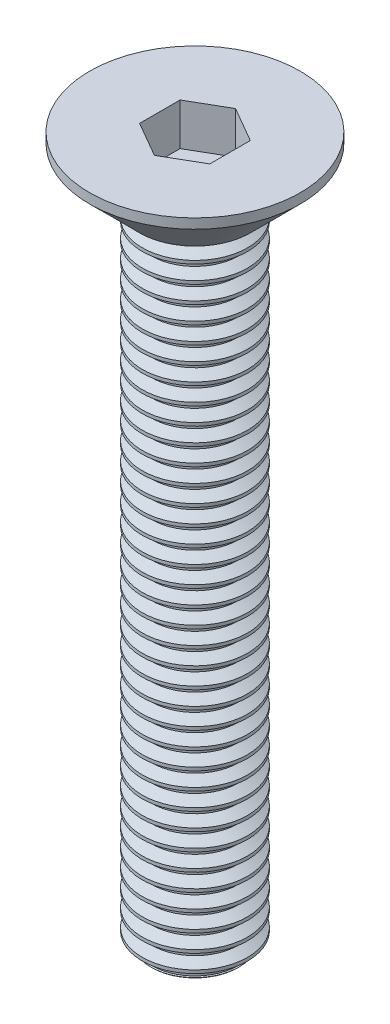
from build123d import *

# Parameters (mm, degrees)
GRIP_DEPTH          = 1.2
THREAD_SIMPLE_COUNT = 37
THREAD_SIMPLE_PITCH = 0.5


with BuildPart() as part:
    # Sketch2 → Body (revolve)
    with BuildSketch(Plane.XY):
        Polygon((0, -20), (1.226987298, -20), (1.5, -19.726987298), (1.5, -1.7), (1.58, -1.7), (3, -0.28), (3, 0), (0, 0), align=None)
    revolve(axis=Axis((0, 0, 0), (0, -1, 0)))

    # Sketch7 → Grip (cut)
    with BuildSketch(Plane(origin=(0, 0, 0), x_dir=(1, 0, 0), z_dir=(0, 1, 0))):
        Polygon((1, -0.577350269), (1, 0.577350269), (0, 1.154700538), (-1, 0.577350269), (-1, -0.577350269), (0, -1.154700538), align=None)
    extrude(amount=-GRIP_DEPTH, mode=Mode.SUBTRACT)

    # Sketch3 → Thread-Single (revolve, cut)
    with BuildSketch(Plane.XY):
        Polygon((1.5, -1.7), (1.226987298, -1.857623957), (1.226987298, -1.95), (1.5, -2.107623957), align=None)
    thread_single = revolve(axis=Axis((0, -20, 0), (0, 1, 0)), mode=Mode.SUBTRACT)

    # Thread-Simple: Thread-Single ×37
    with Locations(*[(0, -i * THREAD_SIMPLE_PITCH, 0) for i in range(1, THREAD_SIMPLE_COUNT)]):
        add(thread_single, mode=Mode.SUBTRACT)


solid = part.part
